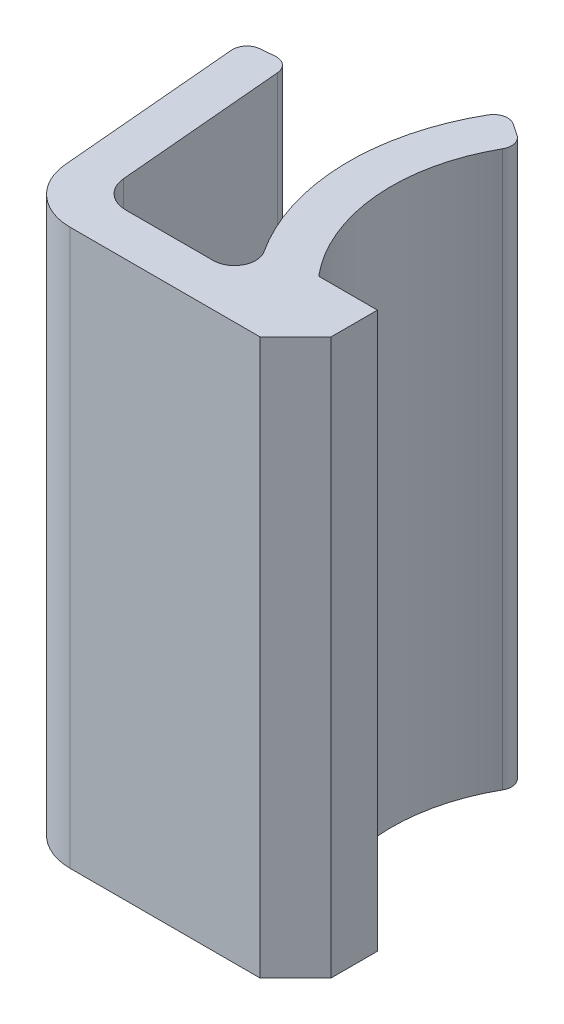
from build123d import *
from OCP.BRepFilletAPI import BRepFilletAPI_MakeFillet

# Parameters (mm, degrees)
BOSS_EXTRU_1_DEPTH = 7.8
CONG_1_R1          = 0.4
CONG_1_R2          = 0.6
CONG_1_R3          = 0.8
CONG_1_R4          = 1.6
CHANFREIN1_SIZE    = 1


with BuildPart() as part:
    # Esquisse1 → Boss.-Extru.1 (new, symmetric)
    with BuildSketch(Plane(origin=(0, 0, 0), x_dir=(1, 0, 0), z_dir=(0, 1, 0))):
        with BuildLine():
            Line((0, 0), (-7.8, 0))
            Line((-7.8, 0), (-8.410090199, 6.973362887))
            Line((-8.410090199, 6.973362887), (-7.214656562, 7.077949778))
            Line((-7.214656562, 7.077949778), (-6.700402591, 1.2))
            Line((-6.700402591, 1.2), (-2.272859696, 1.2))
            ThreePointArc((-2.272859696, 1.2), (-3.995100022, 4.961312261), (-2.968071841, 8.968654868))
            Line((-2.968071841, 8.968654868), (-1.97162783, 8.3))
            ThreePointArc((-1.97162783, 8.3), (-2.812609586, 5.246299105), (-1.65, 2.3))
            Line((-1.65, 2.3), (0, 2.3))
            Line((0, 2.3), (0, 0))
        make_face()
    extrude(amount=BOSS_EXTRU_1_DEPTH, both=True)

    # Cong_1: one fillet with a radius per group of edges: ONE call of the kernel's fillet builder (fillet() takes one radius for all edges)
    cong_1_edges_1 = [part.edges().sort_by_distance(p)[0] for p in [
        (-7.214656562, 0, -7.077949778),
        (-8.410090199, 0, -6.973362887),
        (-2.968071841, 0, -8.968654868),
        (-1.97162783, 0, -8.3),
    ]]
    cong_1_edges_2 = [part.edges().sort_by_distance(p)[0] for p in [
        (-2.272859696, 0, -1.2),
    ]]
    cong_1_edges_3 = [part.edges().sort_by_distance(p)[0] for p in [
        (-6.700402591, 0, -1.2),
    ]]
    cong_1_edges_4 = [part.edges().sort_by_distance(p)[0] for p in [
        (-7.8, 0, 0),
    ]]
    cong_1 = BRepFilletAPI_MakeFillet(part.part.solid().wrapped)
    for e in cong_1_edges_1:
        cong_1.Add(CONG_1_R1, e.wrapped)
    for e in cong_1_edges_2:
        cong_1.Add(CONG_1_R2, e.wrapped)
    for e in cong_1_edges_3:
        cong_1.Add(CONG_1_R3, e.wrapped)
    for e in cong_1_edges_4:
        cong_1.Add(CONG_1_R4, e.wrapped)
    add(Compound.cast(cong_1.Shape()), mode=Mode.REPLACE)

    # Chanfrein1
    chanfrein1_edges = [part.edges().sort_by_distance(p)[0] for p in [
        (0, 0, 0),
    ]]
    chamfer(chanfrein1_edges, length=CHANFREIN1_SIZE)


solid = part.part
